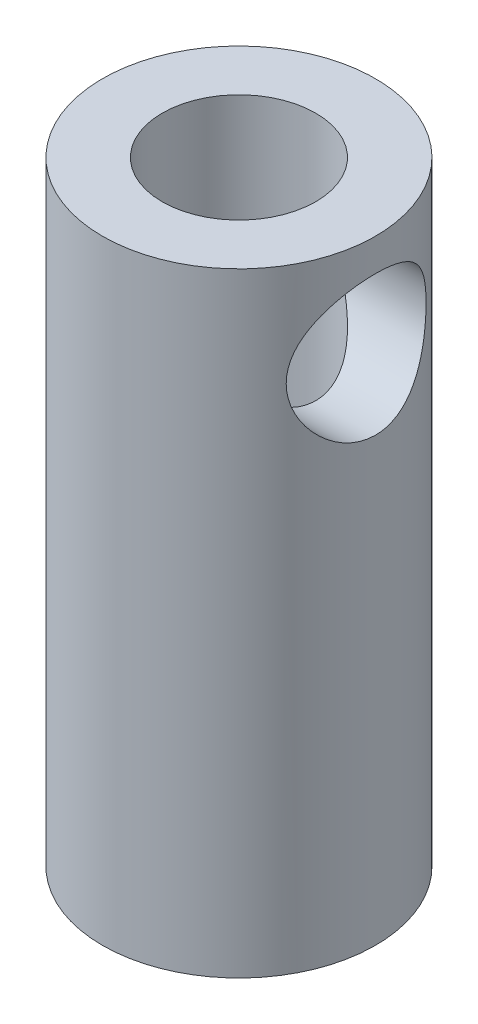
from build123d import *

# Parameters (mm, degrees)
SKETCH1_R           = 4
BOSS_EXTRUDE1_DEPTH = 18
SKETCH2_R           = 2.25
CUT_EXTRUDE1_DEPTH  = 19.867962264
SKETCH4_W           = 2.05
SKETCH4_H           = 4


with BuildPart() as part:
    # Sketch1 → Boss-Extrude1 (new body)
    with BuildSketch(Plane(origin=(0, 0, 0), x_dir=(1, 0, 0), z_dir=(0, 1, 0))):
        with Locations(Location((0, 0, 0), (0, 0, 270))):
            Circle(SKETCH1_R)
    extrude(amount=BOSS_EXTRUDE1_DEPTH)

    # Sketch2 → Cut-Extrude1 (cut, through all)
    with BuildSketch(Plane.XZ):
        with Locations(Location((0, 0, 0), (0, 0, 270))):
            Circle(SKETCH2_R)
    extrude(amount=-CUT_EXTRUDE1_DEPTH, mode=Mode.SUBTRACT)

    # Sketch4 → 4.1 _4.1_ Diameter Hole1 (revolve, cut)
    with BuildSketch(Plane.ZX.offset(15)):
        with Locations((1.025, 2)):
            Rectangle(SKETCH4_W, SKETCH4_H)
    revolve(axis=Axis((-6.35, 15, 0), (1, 0, 0)), mode=Mode.SUBTRACT)


solid = part.part
